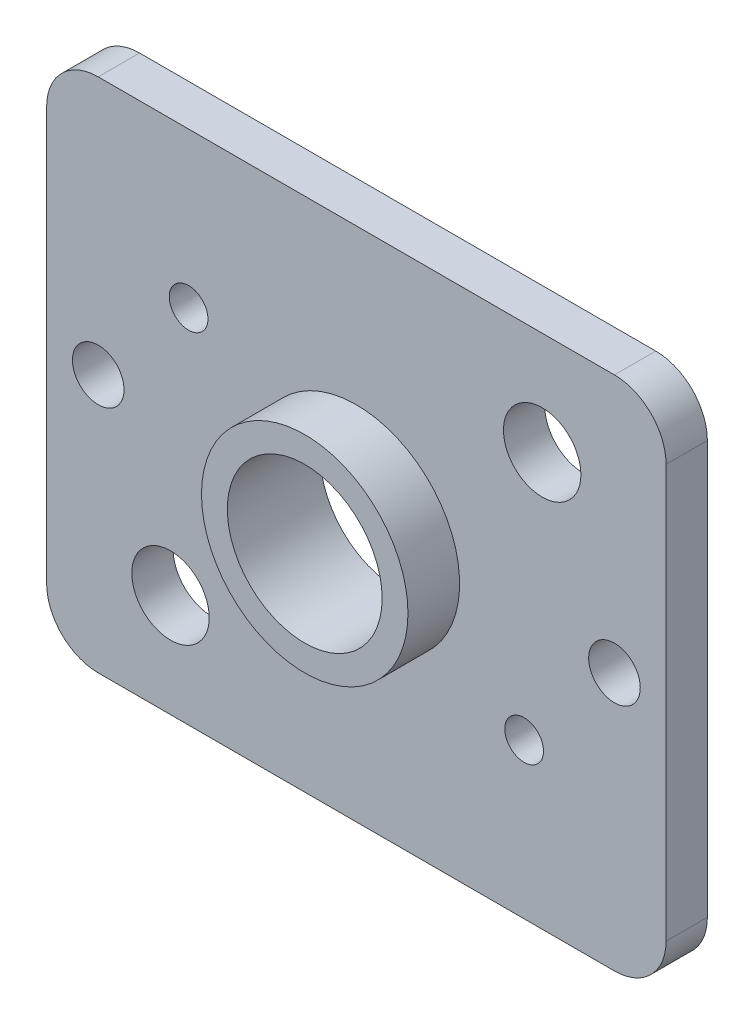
ISO-10303-21;
HEADER;
FILE_DESCRIPTION(('STEP AP214'),'2;1');
FILE_NAME('part.step','',(''),(''),'','','');
FILE_SCHEMA(('AUTOMOTIVE_DESIGN { 1 0 10303 214 1 1 1 1 }'));
ENDSEC;
DATA;
#1=APPLICATION_CONTEXT('core data for automotive mechanical design processes');
#2=APPLICATION_PROTOCOL_DEFINITION('international standard','automotive_design',2000,#1);
#3=PRODUCT_CONTEXT('',#1,'mechanical');
#4=PRODUCT('Part','Part','',(#3));
#5=PRODUCT_RELATED_PRODUCT_CATEGORY('part','',(#4));
#6=PRODUCT_DEFINITION_FORMATION('','',#4);
#7=PRODUCT_DEFINITION_CONTEXT('part definition',#1,'design');
#8=PRODUCT_DEFINITION('design','',#6,#7);
#9=PRODUCT_DEFINITION_SHAPE('','',#8);
#10=(LENGTH_UNIT() NAMED_UNIT(*) SI_UNIT(.MILLI.,.METRE.));
#11=(NAMED_UNIT(*) PLANE_ANGLE_UNIT() SI_UNIT($,.RADIAN.));
#12=(NAMED_UNIT(*) SI_UNIT($,.STERADIAN.) SOLID_ANGLE_UNIT());
#13=UNCERTAINTY_MEASURE_WITH_UNIT(LENGTH_MEASURE(1.E-05),#10,'distance_accuracy_value','');
#14=(GEOMETRIC_REPRESENTATION_CONTEXT(3) GLOBAL_UNCERTAINTY_ASSIGNED_CONTEXT((#13)) GLOBAL_UNIT_ASSIGNED_CONTEXT((#10,
#11,#12)) REPRESENTATION_CONTEXT('',''));
#15=CARTESIAN_POINT('',(0.,0.,0.));
#16=DIRECTION('',(0.,0.,1.));
#17=DIRECTION('',(1.,0.,0.));
#18=AXIS2_PLACEMENT_3D('',#15,#16,#17);
#19=CARTESIAN_POINT('',(0.,0.,0.8));
#20=DIRECTION('',(0.,0.,-1.));
#21=DIRECTION('',(-1.,0.,0.));
#22=AXIS2_PLACEMENT_3D('',#19,#20,#21);
#23=PLANE('',#22);
#24=DIRECTION('',(1.,0.,0.));
#25=VECTOR('',#24,1.);
#26=CARTESIAN_POINT('',(-6.,-5.,0.8));
#27=LINE('',#26,#25);
#28=CARTESIAN_POINT('',(-5.,-5.,0.8));
#29=VERTEX_POINT('',#28);
#30=CARTESIAN_POINT('',(5.,-5.,0.8));
#31=VERTEX_POINT('',#30);
#32=EDGE_CURVE('E137',#29,#31,#27,.T.);
#33=ORIENTED_EDGE('',*,*,#32,.T.);
#34=CARTESIAN_POINT('',(5.,-4.,0.8));
#35=DIRECTION('',(0.,0.,-1.));
#36=DIRECTION('',(-1.,0.,0.));
#37=AXIS2_PLACEMENT_3D('',#34,#35,#36);
#38=CIRCLE('',#37,1.);
#39=CARTESIAN_POINT('',(6.,-4.,0.8));
#40=VERTEX_POINT('',#39);
#41=EDGE_CURVE('E156',#31,#40,#38,.F.);
#42=ORIENTED_EDGE('',*,*,#41,.T.);
#43=DIRECTION('',(0.,1.,0.));
#44=VECTOR('',#43,1.);
#45=CARTESIAN_POINT('',(6.,-5.,0.8));
#46=LINE('',#45,#44);
#47=CARTESIAN_POINT('',(6.,4.,0.8));
#48=VERTEX_POINT('',#47);
#49=EDGE_CURVE('E121',#40,#48,#46,.T.);
#50=ORIENTED_EDGE('',*,*,#49,.T.);
#51=CARTESIAN_POINT('',(5.,4.,0.8));
#52=DIRECTION('',(0.,0.,-1.));
#53=DIRECTION('',(-1.,0.,0.));
#54=AXIS2_PLACEMENT_3D('',#51,#52,#53);
#55=CIRCLE('',#54,1.);
#56=CARTESIAN_POINT('',(5.,5.,0.8));
#57=VERTEX_POINT('',#56);
#58=EDGE_CURVE('E151',#48,#57,#55,.F.);
#59=ORIENTED_EDGE('',*,*,#58,.T.);
#60=DIRECTION('',(-1.,0.,0.));
#61=VECTOR('',#60,1.);
#62=CARTESIAN_POINT('',(-6.,5.,0.8));
#63=LINE('',#62,#61);
#64=CARTESIAN_POINT('',(-5.,5.,0.8));
#65=VERTEX_POINT('',#64);
#66=EDGE_CURVE('E168',#57,#65,#63,.T.);
#67=ORIENTED_EDGE('',*,*,#66,.T.);
#68=CARTESIAN_POINT('',(-5.,4.,0.8));
#69=DIRECTION('',(0.,0.,-1.));
#70=DIRECTION('',(-1.,0.,0.));
#71=AXIS2_PLACEMENT_3D('',#68,#69,#70);
#72=CIRCLE('',#71,1.);
#73=CARTESIAN_POINT('',(-6.,4.,0.8));
#74=VERTEX_POINT('',#73);
#75=EDGE_CURVE('E56',#65,#74,#72,.F.);
#76=ORIENTED_EDGE('',*,*,#75,.T.);
#77=DIRECTION('',(0.,-1.,0.));
#78=VECTOR('',#77,1.);
#79=CARTESIAN_POINT('',(-6.,-5.,0.8));
#80=LINE('',#79,#78);
#81=CARTESIAN_POINT('',(-6.,-4.,0.8));
#82=VERTEX_POINT('',#81);
#83=EDGE_CURVE('E174',#74,#82,#80,.T.);
#84=ORIENTED_EDGE('',*,*,#83,.T.);
#85=CARTESIAN_POINT('',(-5.,-4.,0.8));
#86=DIRECTION('',(0.,0.,-1.));
#87=DIRECTION('',(-1.,0.,0.));
#88=AXIS2_PLACEMENT_3D('',#85,#86,#87);
#89=CIRCLE('',#88,1.);
#90=EDGE_CURVE('E154',#82,#29,#89,.F.);
#91=ORIENTED_EDGE('',*,*,#90,.T.);
#92=EDGE_LOOP('',(#33,#42,#50,#59,#67,#76,#84,#91));
#93=FACE_BOUND('',#92,.T.);
#94=CARTESIAN_POINT('',(-3.6,-3.,0.8));
#95=DIRECTION('',(0.,0.,1.));
#96=DIRECTION('',(1.,0.,0.));
#97=AXIS2_PLACEMENT_3D('',#94,#95,#96);
#98=CIRCLE('',#97,0.75);
#99=CARTESIAN_POINT('',(-2.84999999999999,-3.,0.8));
#100=VERTEX_POINT('',#99);
#101=EDGE_CURVE('E134',#100,#100,#98,.T.);
#102=ORIENTED_EDGE('',*,*,#101,.F.);
#103=EDGE_LOOP('',(#102));
#104=FACE_BOUND('',#103,.T.);
#105=CARTESIAN_POINT('',(3.6,3.,0.8));
#106=DIRECTION('',(0.,0.,1.));
#107=DIRECTION('',(1.,0.,0.));
#108=AXIS2_PLACEMENT_3D('',#105,#106,#107);
#109=CIRCLE('',#108,0.750000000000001);
#110=CARTESIAN_POINT('',(4.35,3.,0.8));
#111=VERTEX_POINT('',#110);
#112=EDGE_CURVE('E192',#111,#111,#109,.T.);
#113=ORIENTED_EDGE('',*,*,#112,.F.);
#114=EDGE_LOOP('',(#113));
#115=FACE_BOUND('',#114,.T.);
#116=CARTESIAN_POINT('',(3.25,-2.,0.8));
#117=DIRECTION('',(0.,0.,1.));
#118=DIRECTION('',(1.,0.,0.));
#119=AXIS2_PLACEMENT_3D('',#116,#117,#118);
#120=CIRCLE('',#119,0.375);
#121=CARTESIAN_POINT('',(3.625,-2.,0.8));
#122=VERTEX_POINT('',#121);
#123=EDGE_CURVE('E193',#122,#122,#120,.T.);
#124=ORIENTED_EDGE('',*,*,#123,.F.);
#125=EDGE_LOOP('',(#124));
#126=FACE_BOUND('',#125,.T.);
#127=CARTESIAN_POINT('',(-3.24999999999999,2.00000000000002,0.8));
#128=DIRECTION('',(0.,0.,1.));
#129=DIRECTION('',(1.,0.,0.));
#130=AXIS2_PLACEMENT_3D('',#127,#128,#129);
#131=CIRCLE('',#130,0.375);
#132=CARTESIAN_POINT('',(-2.87499999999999,2.00000000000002,0.8));
#133=VERTEX_POINT('',#132);
#134=EDGE_CURVE('E204',#133,#133,#131,.T.);
#135=ORIENTED_EDGE('',*,*,#134,.F.);
#136=EDGE_LOOP('',(#135));
#137=FACE_BOUND('',#136,.T.);
#138=CARTESIAN_POINT('',(-5.,0.,0.8));
#139=DIRECTION('',(0.,0.,1.));
#140=DIRECTION('',(1.,0.,0.));
#141=AXIS2_PLACEMENT_3D('',#138,#139,#140);
#142=CIRCLE('',#141,0.500000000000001);
#143=CARTESIAN_POINT('',(-4.5,0.,0.8));
#144=VERTEX_POINT('',#143);
#145=EDGE_CURVE('E213',#144,#144,#142,.T.);
#146=ORIENTED_EDGE('',*,*,#145,.F.);
#147=EDGE_LOOP('',(#146));
#148=FACE_BOUND('',#147,.T.);
#149=CARTESIAN_POINT('',(5.,0.,0.8));
#150=DIRECTION('',(0.,0.,1.));
#151=DIRECTION('',(1.,0.,0.));
#152=AXIS2_PLACEMENT_3D('',#149,#150,#151);
#153=CIRCLE('',#152,0.500000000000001);
#154=CARTESIAN_POINT('',(5.5,0.,0.8));
#155=VERTEX_POINT('',#154);
#156=EDGE_CURVE('E219',#155,#155,#153,.T.);
#157=ORIENTED_EDGE('',*,*,#156,.F.);
#158=EDGE_LOOP('',(#157));
#159=FACE_BOUND('',#158,.T.);
#160=CARTESIAN_POINT('',(0.,0.,0.8));
#161=DIRECTION('',(0.,0.,-1.));
#162=DIRECTION('',(-1.,0.,0.));
#163=AXIS2_PLACEMENT_3D('',#160,#161,#162);
#164=CIRCLE('',#163,2.);
#165=CARTESIAN_POINT('',(-2.,0.,0.8));
#166=VERTEX_POINT('',#165);
#167=EDGE_CURVE('E11',#166,#166,#164,.F.);
#168=ORIENTED_EDGE('',*,*,#167,.F.);
#169=EDGE_LOOP('',(#168));
#170=FACE_BOUND('',#169,.T.);
#171=ADVANCED_FACE('F34',(#93,#104,#115,#126,#137,#148,#159,#170),#23,.F.);
#172=CARTESIAN_POINT('',(6.,-5.,0.8));
#173=DIRECTION('',(-1.,0.,0.));
#174=DIRECTION('',(0.,0.,1.));
#175=AXIS2_PLACEMENT_3D('',#172,#173,#174);
#176=PLANE('',#175);
#177=ORIENTED_EDGE('',*,*,#49,.F.);
#178=DIRECTION('',(0.,0.,-1.));
#179=VECTOR('',#178,1.);
#180=CARTESIAN_POINT('',(6.,-4.,0.8));
#181=LINE('',#180,#179);
#182=CARTESIAN_POINT('',(6.,-4.,0.));
#183=VERTEX_POINT('',#182);
#184=EDGE_CURVE('E105',#40,#183,#181,.T.);
#185=ORIENTED_EDGE('',*,*,#184,.T.);
#186=DIRECTION('',(0.,1.,0.));
#187=VECTOR('',#186,1.);
#188=CARTESIAN_POINT('',(6.,-5.,0.));
#189=LINE('',#188,#187);
#190=CARTESIAN_POINT('',(6.,4.,0.));
#191=VERTEX_POINT('',#190);
#192=EDGE_CURVE('E118',#183,#191,#189,.T.);
#193=ORIENTED_EDGE('',*,*,#192,.T.);
#194=DIRECTION('',(0.,0.,-1.));
#195=VECTOR('',#194,1.);
#196=CARTESIAN_POINT('',(6.,4.,0.8));
#197=LINE('',#196,#195);
#198=EDGE_CURVE('E123',#191,#48,#197,.F.);
#199=ORIENTED_EDGE('',*,*,#198,.T.);
#200=EDGE_LOOP('',(#177,#185,#193,#199));
#201=FACE_BOUND('',#200,.T.);
#202=ADVANCED_FACE('F117',(#201),#176,.F.);
#203=CARTESIAN_POINT('',(-6.,5.,0.8));
#204=DIRECTION('',(0.,-1.,0.));
#205=DIRECTION('',(0.,0.,-1.));
#206=AXIS2_PLACEMENT_3D('',#203,#204,#205);
#207=PLANE('',#206);
#208=DIRECTION('',(-1.,0.,0.));
#209=VECTOR('',#208,1.);
#210=CARTESIAN_POINT('',(-6.,5.,0.));
#211=LINE('',#210,#209);
#212=CARTESIAN_POINT('',(5.,5.,0.));
#213=VERTEX_POINT('',#212);
#214=CARTESIAN_POINT('',(-5.,5.,0.));
#215=VERTEX_POINT('',#214);
#216=EDGE_CURVE('E127',#213,#215,#211,.T.);
#217=ORIENTED_EDGE('',*,*,#216,.T.);
#218=DIRECTION('',(0.,0.,-1.));
#219=VECTOR('',#218,1.);
#220=CARTESIAN_POINT('',(-5.,5.,0.8));
#221=LINE('',#220,#219);
#222=EDGE_CURVE('E42',#215,#65,#221,.F.);
#223=ORIENTED_EDGE('',*,*,#222,.T.);
#224=ORIENTED_EDGE('',*,*,#66,.F.);
#225=DIRECTION('',(0.,0.,-1.));
#226=VECTOR('',#225,1.);
#227=CARTESIAN_POINT('',(5.,5.,0.8));
#228=LINE('',#227,#226);
#229=EDGE_CURVE('E162',#57,#213,#228,.T.);
#230=ORIENTED_EDGE('',*,*,#229,.T.);
#231=EDGE_LOOP('',(#217,#223,#224,#230));
#232=FACE_BOUND('',#231,.T.);
#233=ADVANCED_FACE('F167',(#232),#207,.F.);
#234=CARTESIAN_POINT('',(-6.,-5.,0.8));
#235=DIRECTION('',(1.,0.,0.));
#236=DIRECTION('',(0.,0.,-1.));
#237=AXIS2_PLACEMENT_3D('',#234,#235,#236);
#238=PLANE('',#237);
#239=DIRECTION('',(0.,-1.,0.));
#240=VECTOR('',#239,1.);
#241=CARTESIAN_POINT('',(-6.,-5.,0.));
#242=LINE('',#241,#240);
#243=CARTESIAN_POINT('',(-6.,4.,0.));
#244=VERTEX_POINT('',#243);
#245=CARTESIAN_POINT('',(-6.,-4.,0.));
#246=VERTEX_POINT('',#245);
#247=EDGE_CURVE('E131',#244,#246,#242,.T.);
#248=ORIENTED_EDGE('',*,*,#247,.T.);
#249=DIRECTION('',(0.,0.,-1.));
#250=VECTOR('',#249,1.);
#251=CARTESIAN_POINT('',(-6.,-4.,0.8));
#252=LINE('',#251,#250);
#253=EDGE_CURVE('E49',#246,#82,#252,.F.);
#254=ORIENTED_EDGE('',*,*,#253,.T.);
#255=ORIENTED_EDGE('',*,*,#83,.F.);
#256=DIRECTION('',(0.,0.,-1.));
#257=VECTOR('',#256,1.);
#258=CARTESIAN_POINT('',(-6.,4.,0.8));
#259=LINE('',#258,#257);
#260=EDGE_CURVE('E158',#74,#244,#259,.T.);
#261=ORIENTED_EDGE('',*,*,#260,.T.);
#262=EDGE_LOOP('',(#248,#254,#255,#261));
#263=FACE_BOUND('',#262,.T.);
#264=ADVANCED_FACE('F179',(#263),#238,.F.);
#265=CARTESIAN_POINT('',(-6.,-5.,0.8));
#266=DIRECTION('',(0.,1.,0.));
#267=DIRECTION('',(0.,0.,1.));
#268=AXIS2_PLACEMENT_3D('',#265,#266,#267);
#269=PLANE('',#268);
#270=DIRECTION('',(1.,0.,0.));
#271=VECTOR('',#270,1.);
#272=CARTESIAN_POINT('',(-6.,-5.,0.));
#273=LINE('',#272,#271);
#274=CARTESIAN_POINT('',(-5.,-5.,0.));
#275=VERTEX_POINT('',#274);
#276=CARTESIAN_POINT('',(5.,-5.,0.));
#277=VERTEX_POINT('',#276);
#278=EDGE_CURVE('E141',#275,#277,#273,.T.);
#279=ORIENTED_EDGE('',*,*,#278,.T.);
#280=DIRECTION('',(0.,0.,-1.));
#281=VECTOR('',#280,1.);
#282=CARTESIAN_POINT('',(5.,-5.,0.8));
#283=LINE('',#282,#281);
#284=EDGE_CURVE('E106',#277,#31,#283,.F.);
#285=ORIENTED_EDGE('',*,*,#284,.T.);
#286=ORIENTED_EDGE('',*,*,#32,.F.);
#287=DIRECTION('',(0.,0.,-1.));
#288=VECTOR('',#287,1.);
#289=CARTESIAN_POINT('',(-5.,-5.,0.8));
#290=LINE('',#289,#288);
#291=EDGE_CURVE('E111',#29,#275,#290,.T.);
#292=ORIENTED_EDGE('',*,*,#291,.T.);
#293=EDGE_LOOP('',(#279,#285,#286,#292));
#294=FACE_BOUND('',#293,.T.);
#295=ADVANCED_FACE('F186',(#294),#269,.F.);
#296=CARTESIAN_POINT('',(0.,0.,0.));
#297=DIRECTION('',(0.,0.,-1.));
#298=DIRECTION('',(-1.,0.,0.));
#299=AXIS2_PLACEMENT_3D('',#296,#297,#298);
#300=PLANE('',#299);
#301=CARTESIAN_POINT('',(5.,0.,0.));
#302=DIRECTION('',(0.,0.,1.));
#303=DIRECTION('',(1.,0.,0.));
#304=AXIS2_PLACEMENT_3D('',#301,#302,#303);
#305=CIRCLE('',#304,0.500000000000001);
#306=CARTESIAN_POINT('',(5.5,0.,0.));
#307=VERTEX_POINT('',#306);
#308=EDGE_CURVE('E216',#307,#307,#305,.T.);
#309=ORIENTED_EDGE('',*,*,#308,.T.);
#310=EDGE_LOOP('',(#309));
#311=FACE_BOUND('',#310,.T.);
#312=CARTESIAN_POINT('',(-5.,0.,0.));
#313=DIRECTION('',(0.,0.,1.));
#314=DIRECTION('',(1.,0.,0.));
#315=AXIS2_PLACEMENT_3D('',#312,#313,#314);
#316=CIRCLE('',#315,0.500000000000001);
#317=CARTESIAN_POINT('',(-4.5,0.,0.));
#318=VERTEX_POINT('',#317);
#319=EDGE_CURVE('E205',#318,#318,#316,.T.);
#320=ORIENTED_EDGE('',*,*,#319,.T.);
#321=EDGE_LOOP('',(#320));
#322=FACE_BOUND('',#321,.T.);
#323=CARTESIAN_POINT('',(-3.24999999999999,2.00000000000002,0.));
#324=DIRECTION('',(0.,0.,-1.));
#325=DIRECTION('',(-1.,0.,0.));
#326=AXIS2_PLACEMENT_3D('',#323,#324,#325);
#327=CIRCLE('',#326,0.375);
#328=CARTESIAN_POINT('',(-3.62499999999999,2.00000000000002,0.));
#329=VERTEX_POINT('',#328);
#330=EDGE_CURVE('E201',#329,#329,#327,.F.);
#331=ORIENTED_EDGE('',*,*,#330,.T.);
#332=EDGE_LOOP('',(#331));
#333=FACE_BOUND('',#332,.T.);
#334=CARTESIAN_POINT('',(3.25,-2.,0.));
#335=DIRECTION('',(0.,0.,-1.));
#336=DIRECTION('',(-1.,0.,0.));
#337=AXIS2_PLACEMENT_3D('',#334,#335,#336);
#338=CIRCLE('',#337,0.375);
#339=CARTESIAN_POINT('',(2.875,-2.,0.));
#340=VERTEX_POINT('',#339);
#341=EDGE_CURVE('E208',#340,#340,#338,.F.);
#342=ORIENTED_EDGE('',*,*,#341,.T.);
#343=EDGE_LOOP('',(#342));
#344=FACE_BOUND('',#343,.T.);
#345=CARTESIAN_POINT('',(3.6,3.,0.));
#346=DIRECTION('',(0.,0.,-1.));
#347=DIRECTION('',(-1.,0.,0.));
#348=AXIS2_PLACEMENT_3D('',#345,#346,#347);
#349=CIRCLE('',#348,0.750000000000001);
#350=CARTESIAN_POINT('',(4.35,3.,0.));
#351=VERTEX_POINT('',#350);
#352=EDGE_CURVE('E189',#351,#351,#349,.F.);
#353=ORIENTED_EDGE('',*,*,#352,.T.);
#354=EDGE_LOOP('',(#353));
#355=FACE_BOUND('',#354,.T.);
#356=CARTESIAN_POINT('',(-3.6,-3.,0.));
#357=DIRECTION('',(0.,0.,-1.));
#358=DIRECTION('',(-1.,0.,0.));
#359=AXIS2_PLACEMENT_3D('',#356,#357,#358);
#360=CIRCLE('',#359,0.75);
#361=CARTESIAN_POINT('',(-2.84999999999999,-3.,0.));
#362=VERTEX_POINT('',#361);
#363=EDGE_CURVE('E196',#362,#362,#360,.F.);
#364=ORIENTED_EDGE('',*,*,#363,.T.);
#365=EDGE_LOOP('',(#364));
#366=FACE_BOUND('',#365,.T.);
#367=CARTESIAN_POINT('',(0.,0.,0.));
#368=DIRECTION('',(0.,0.,-1.));
#369=DIRECTION('',(-1.,0.,0.));
#370=AXIS2_PLACEMENT_3D('',#367,#368,#369);
#371=CIRCLE('',#370,1.5);
#372=CARTESIAN_POINT('',(1.5,0.,0.));
#373=VERTEX_POINT('',#372);
#374=EDGE_CURVE('E128',#373,#373,#371,.F.);
#375=ORIENTED_EDGE('',*,*,#374,.T.);
#376=EDGE_LOOP('',(#375));
#377=FACE_BOUND('',#376,.T.);
#378=ORIENTED_EDGE('',*,*,#192,.F.);
#379=CARTESIAN_POINT('',(5.,-4.,0.));
#380=DIRECTION('',(0.,0.,-1.));
#381=DIRECTION('',(-1.,0.,0.));
#382=AXIS2_PLACEMENT_3D('',#379,#380,#381);
#383=CIRCLE('',#382,1.);
#384=EDGE_CURVE('E101',#183,#277,#383,.T.);
#385=ORIENTED_EDGE('',*,*,#384,.T.);
#386=ORIENTED_EDGE('',*,*,#278,.F.);
#387=CARTESIAN_POINT('',(-5.,-4.,0.));
#388=DIRECTION('',(0.,0.,-1.));
#389=DIRECTION('',(-1.,0.,0.));
#390=AXIS2_PLACEMENT_3D('',#387,#388,#389);
#391=CIRCLE('',#390,1.);
#392=EDGE_CURVE('E112',#275,#246,#391,.T.);
#393=ORIENTED_EDGE('',*,*,#392,.T.);
#394=ORIENTED_EDGE('',*,*,#247,.F.);
#395=CARTESIAN_POINT('',(-5.,4.,0.));
#396=DIRECTION('',(0.,0.,-1.));
#397=DIRECTION('',(-1.,0.,0.));
#398=AXIS2_PLACEMENT_3D('',#395,#396,#397);
#399=CIRCLE('',#398,1.);
#400=EDGE_CURVE('E145',#244,#215,#399,.T.);
#401=ORIENTED_EDGE('',*,*,#400,.T.);
#402=ORIENTED_EDGE('',*,*,#216,.F.);
#403=CARTESIAN_POINT('',(5.,4.,0.));
#404=DIRECTION('',(0.,0.,-1.));
#405=DIRECTION('',(-1.,0.,0.));
#406=AXIS2_PLACEMENT_3D('',#403,#404,#405);
#407=CIRCLE('',#406,1.);
#408=EDGE_CURVE('E122',#213,#191,#407,.T.);
#409=ORIENTED_EDGE('',*,*,#408,.T.);
#410=EDGE_LOOP('',(#378,#385,#386,#393,#394,#401,#402,#409));
#411=FACE_BOUND('',#410,.T.);
#412=ADVANCED_FACE('F125',(#311,#322,#333,#344,#355,#366,#377,#411),#300,.T.);
#413=CARTESIAN_POINT('',(0.,0.,-0.00100000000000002));
#414=DIRECTION('',(0.,0.,1.));
#415=DIRECTION('',(1.,0.,0.));
#416=AXIS2_PLACEMENT_3D('',#413,#414,#415);
#417=CYLINDRICAL_SURFACE('',#416,1.5);
#418=CARTESIAN_POINT('',(0.,0.,1.8));
#419=DIRECTION('',(0.,0.,1.));
#420=DIRECTION('',(1.,0.,0.));
#421=AXIS2_PLACEMENT_3D('',#418,#419,#420);
#422=CIRCLE('',#421,1.5);
#423=CARTESIAN_POINT('',(1.5,0.,1.8));
#424=VERTEX_POINT('',#423);
#425=EDGE_CURVE('E227',#424,#424,#422,.T.);
#426=CARTESIAN_POINT('',(1.5,0.,0.));
#427=CARTESIAN_POINT('',(1.5,0.,0.01875));
#428=CARTESIAN_POINT('',(1.5,0.,0.0375));
#429=CARTESIAN_POINT('',(1.5,0.,0.075));
#430=CARTESIAN_POINT('',(1.5,0.,0.09375));
#431=CARTESIAN_POINT('',(1.5,0.,0.13125));
#432=CARTESIAN_POINT('',(1.5,0.,0.15));
#433=CARTESIAN_POINT('',(1.5,0.,0.1875));
#434=CARTESIAN_POINT('',(1.5,0.,0.20625));
#435=CARTESIAN_POINT('',(1.5,0.,0.24375));
#436=CARTESIAN_POINT('',(1.5,0.,0.2625));
#437=CARTESIAN_POINT('',(1.5,0.,0.3));
#438=CARTESIAN_POINT('',(1.5,0.,0.31875));
#439=CARTESIAN_POINT('',(1.5,0.,0.35625));
#440=CARTESIAN_POINT('',(1.5,0.,0.375));
#441=CARTESIAN_POINT('',(1.5,0.,0.4125));
#442=CARTESIAN_POINT('',(1.5,0.,0.43125));
#443=CARTESIAN_POINT('',(1.5,0.,0.46875));
#444=CARTESIAN_POINT('',(1.5,0.,0.4875));
#445=CARTESIAN_POINT('',(1.5,0.,0.525));
#446=CARTESIAN_POINT('',(1.5,0.,0.54375));
#447=CARTESIAN_POINT('',(1.5,0.,0.58125));
#448=CARTESIAN_POINT('',(1.5,0.,0.6));
#449=CARTESIAN_POINT('',(1.5,0.,0.6375));
#450=CARTESIAN_POINT('',(1.5,0.,0.65625));
#451=CARTESIAN_POINT('',(1.5,0.,0.69375));
#452=CARTESIAN_POINT('',(1.5,0.,0.7125));
#453=CARTESIAN_POINT('',(1.5,0.,0.75));
#454=CARTESIAN_POINT('',(1.5,0.,0.76875));
#455=CARTESIAN_POINT('',(1.5,0.,0.80625));
#456=CARTESIAN_POINT('',(1.5,0.,0.825));
#457=CARTESIAN_POINT('',(1.5,0.,0.8625));
#458=CARTESIAN_POINT('',(1.5,0.,0.88125));
#459=CARTESIAN_POINT('',(1.5,0.,0.91875));
#460=CARTESIAN_POINT('',(1.5,0.,0.9375));
#461=CARTESIAN_POINT('',(1.5,0.,0.975));
#462=CARTESIAN_POINT('',(1.5,0.,0.99375));
#463=CARTESIAN_POINT('',(1.5,0.,1.03125));
#464=CARTESIAN_POINT('',(1.5,0.,1.05));
#465=CARTESIAN_POINT('',(1.5,0.,1.0875));
#466=CARTESIAN_POINT('',(1.5,0.,1.10625));
#467=CARTESIAN_POINT('',(1.5,0.,1.14375));
#468=CARTESIAN_POINT('',(1.5,0.,1.1625));
#469=CARTESIAN_POINT('',(1.5,0.,1.2));
#470=CARTESIAN_POINT('',(1.5,0.,1.21875));
#471=CARTESIAN_POINT('',(1.5,0.,1.25625));
#472=CARTESIAN_POINT('',(1.5,0.,1.275));
#473=CARTESIAN_POINT('',(1.5,0.,1.3125));
#474=CARTESIAN_POINT('',(1.5,0.,1.33125));
#475=CARTESIAN_POINT('',(1.5,0.,1.36875));
#476=CARTESIAN_POINT('',(1.5,0.,1.3875));
#477=CARTESIAN_POINT('',(1.5,0.,1.425));
#478=CARTESIAN_POINT('',(1.5,0.,1.44375));
#479=CARTESIAN_POINT('',(1.5,0.,1.48125));
#480=CARTESIAN_POINT('',(1.5,0.,1.5));
#481=CARTESIAN_POINT('',(1.5,0.,1.5375));
#482=CARTESIAN_POINT('',(1.5,0.,1.55625));
#483=CARTESIAN_POINT('',(1.5,0.,1.59375));
#484=CARTESIAN_POINT('',(1.5,0.,1.6125));
#485=CARTESIAN_POINT('',(1.5,0.,1.65));
#486=CARTESIAN_POINT('',(1.5,0.,1.66875));
#487=CARTESIAN_POINT('',(1.5,0.,1.70625));
#488=CARTESIAN_POINT('',(1.5,0.,1.725));
#489=CARTESIAN_POINT('',(1.5,0.,1.7625));
#490=CARTESIAN_POINT('',(1.5,0.,1.78125));
#491=CARTESIAN_POINT('',(1.5,0.,1.8));
#492=B_SPLINE_CURVE_WITH_KNOTS('',3,(#426,#427,#428,#429,#430,#431,#432,#433,#434,#435,#436,
#437,#438,#439,#440,#441,#442,#443,#444,#445,#446,#447,#448,#449,#450,#451,#452,#453,#454,#455,
#456,#457,#458,#459,#460,#461,#462,#463,#464,#465,#466,#467,#468,#469,#470,#471,#472,#473,#474,
#475,#476,#477,#478,#479,#480,#481,#482,#483,#484,#485,#486,#487,#488,#489,#490,#491),
.UNSPECIFIED.,.F.,.F.,(4,2,2,2,2,2,2,2,2,2,2,2,2,2,2,2,2,2,2,2,2,2,2,2,2,2,2,2,2,2,2,2,4),(0.,
0.05625,0.1125,0.16875,0.225,0.28125,0.3375,0.39375,0.45,0.50625,0.5625,0.61875,0.675,0.73125,
0.7875,0.84375,0.9,0.95625,1.0125,1.06875,1.125,1.18125,1.2375,1.29375,1.35,1.40625,1.4625,
1.51875,1.575,1.63125,1.6875,1.74375,1.8),.UNSPECIFIED.);
#493=EDGE_CURVE('BSEAM231',#373,#424,#492,.T.);
#494=ORIENTED_EDGE('',*,*,#374,.F.);
#495=ORIENTED_EDGE('',*,*,#425,.T.);
#496=ORIENTED_EDGE('',*,*,#493,.T.);
#497=ORIENTED_EDGE('',*,*,#493,.F.);
#498=EDGE_LOOP('',(#494,#496,#495,#497));
#499=FACE_BOUND('',#498,.T.);
#500=ADVANCED_FACE('F231',(#499),#417,.F.);
#501=CARTESIAN_POINT('',(-3.6,-3.,-0.00100000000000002));
#502=DIRECTION('',(0.,0.,1.));
#503=DIRECTION('',(1.,0.,0.));
#504=AXIS2_PLACEMENT_3D('',#501,#502,#503);
#505=CYLINDRICAL_SURFACE('',#504,0.75);
#506=CARTESIAN_POINT('',(-2.84999999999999,-3.,0.));
#507=CARTESIAN_POINT('',(-2.84999999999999,-3.,0.00833333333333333));
#508=CARTESIAN_POINT('',(-2.84999999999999,-3.,0.0166666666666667));
#509=CARTESIAN_POINT('',(-2.84999999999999,-3.,0.0333333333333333));
#510=CARTESIAN_POINT('',(-2.84999999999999,-3.,0.0416666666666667));
#511=CARTESIAN_POINT('',(-2.84999999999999,-3.,0.0583333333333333));
#512=CARTESIAN_POINT('',(-2.84999999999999,-3.,0.0666666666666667));
#513=CARTESIAN_POINT('',(-2.84999999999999,-3.,0.0833333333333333));
#514=CARTESIAN_POINT('',(-2.84999999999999,-3.,0.0916666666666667));
#515=CARTESIAN_POINT('',(-2.84999999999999,-3.,0.108333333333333));
#516=CARTESIAN_POINT('',(-2.84999999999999,-3.,0.116666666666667));
#517=CARTESIAN_POINT('',(-2.84999999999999,-3.,0.133333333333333));
#518=CARTESIAN_POINT('',(-2.84999999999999,-3.,0.141666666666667));
#519=CARTESIAN_POINT('',(-2.84999999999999,-3.,0.158333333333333));
#520=CARTESIAN_POINT('',(-2.84999999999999,-3.,0.166666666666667));
#521=CARTESIAN_POINT('',(-2.84999999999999,-3.,0.183333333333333));
#522=CARTESIAN_POINT('',(-2.84999999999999,-3.,0.191666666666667));
#523=CARTESIAN_POINT('',(-2.84999999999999,-3.,0.208333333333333));
#524=CARTESIAN_POINT('',(-2.84999999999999,-3.,0.216666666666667));
#525=CARTESIAN_POINT('',(-2.84999999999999,-3.,0.233333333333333));
#526=CARTESIAN_POINT('',(-2.84999999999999,-3.,0.241666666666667));
#527=CARTESIAN_POINT('',(-2.84999999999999,-3.,0.258333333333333));
#528=CARTESIAN_POINT('',(-2.84999999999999,-3.,0.266666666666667));
#529=CARTESIAN_POINT('',(-2.84999999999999,-3.,0.283333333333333));
#530=CARTESIAN_POINT('',(-2.84999999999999,-3.,0.291666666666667));
#531=CARTESIAN_POINT('',(-2.84999999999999,-3.,0.308333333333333));
#532=CARTESIAN_POINT('',(-2.84999999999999,-3.,0.316666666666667));
#533=CARTESIAN_POINT('',(-2.84999999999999,-3.,0.333333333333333));
#534=CARTESIAN_POINT('',(-2.84999999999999,-3.,0.341666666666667));
#535=CARTESIAN_POINT('',(-2.84999999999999,-3.,0.358333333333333));
#536=CARTESIAN_POINT('',(-2.84999999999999,-3.,0.366666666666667));
#537=CARTESIAN_POINT('',(-2.84999999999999,-3.,0.383333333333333));
#538=CARTESIAN_POINT('',(-2.84999999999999,-3.,0.391666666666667));
#539=CARTESIAN_POINT('',(-2.84999999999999,-3.,0.408333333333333));
#540=CARTESIAN_POINT('',(-2.84999999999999,-3.,0.416666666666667));
#541=CARTESIAN_POINT('',(-2.84999999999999,-3.,0.433333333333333));
#542=CARTESIAN_POINT('',(-2.84999999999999,-3.,0.441666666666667));
#543=CARTESIAN_POINT('',(-2.84999999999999,-3.,0.458333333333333));
#544=CARTESIAN_POINT('',(-2.84999999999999,-3.,0.466666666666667));
#545=CARTESIAN_POINT('',(-2.84999999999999,-3.,0.483333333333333));
#546=CARTESIAN_POINT('',(-2.84999999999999,-3.,0.491666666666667));
#547=CARTESIAN_POINT('',(-2.84999999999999,-3.,0.508333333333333));
#548=CARTESIAN_POINT('',(-2.84999999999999,-3.,0.516666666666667));
#549=CARTESIAN_POINT('',(-2.84999999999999,-3.,0.533333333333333));
#550=CARTESIAN_POINT('',(-2.84999999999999,-3.,0.541666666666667));
#551=CARTESIAN_POINT('',(-2.84999999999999,-3.,0.558333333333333));
#552=CARTESIAN_POINT('',(-2.84999999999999,-3.,0.566666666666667));
#553=CARTESIAN_POINT('',(-2.84999999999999,-3.,0.583333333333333));
#554=CARTESIAN_POINT('',(-2.84999999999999,-3.,0.591666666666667));
#555=CARTESIAN_POINT('',(-2.84999999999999,-3.,0.608333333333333));
#556=CARTESIAN_POINT('',(-2.84999999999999,-3.,0.616666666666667));
#557=CARTESIAN_POINT('',(-2.84999999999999,-3.,0.633333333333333));
#558=CARTESIAN_POINT('',(-2.84999999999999,-3.,0.641666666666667));
#559=CARTESIAN_POINT('',(-2.84999999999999,-3.,0.658333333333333));
#560=CARTESIAN_POINT('',(-2.84999999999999,-3.,0.666666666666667));
#561=CARTESIAN_POINT('',(-2.84999999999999,-3.,0.683333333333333));
#562=CARTESIAN_POINT('',(-2.84999999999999,-3.,0.691666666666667));
#563=CARTESIAN_POINT('',(-2.84999999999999,-3.,0.708333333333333));
#564=CARTESIAN_POINT('',(-2.84999999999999,-3.,0.716666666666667));
#565=CARTESIAN_POINT('',(-2.84999999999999,-3.,0.733333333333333));
#566=CARTESIAN_POINT('',(-2.84999999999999,-3.,0.741666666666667));
#567=CARTESIAN_POINT('',(-2.84999999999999,-3.,0.758333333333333));
#568=CARTESIAN_POINT('',(-2.84999999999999,-3.,0.766666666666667));
#569=CARTESIAN_POINT('',(-2.84999999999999,-3.,0.783333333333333));
#570=CARTESIAN_POINT('',(-2.84999999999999,-3.,0.791666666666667));
#571=CARTESIAN_POINT('',(-2.84999999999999,-3.,0.8));
#572=B_SPLINE_CURVE_WITH_KNOTS('',3,(#506,#507,#508,#509,#510,#511,#512,#513,#514,#515,#516,
#517,#518,#519,#520,#521,#522,#523,#524,#525,#526,#527,#528,#529,#530,#531,#532,#533,#534,#535,
#536,#537,#538,#539,#540,#541,#542,#543,#544,#545,#546,#547,#548,#549,#550,#551,#552,#553,#554,
#555,#556,#557,#558,#559,#560,#561,#562,#563,#564,#565,#566,#567,#568,#569,#570,#571),
.UNSPECIFIED.,.F.,.F.,(4,2,2,2,2,2,2,2,2,2,2,2,2,2,2,2,2,2,2,2,2,2,2,2,2,2,2,2,2,2,2,2,4),(0.,
0.025,0.05,0.075,0.1,0.125,0.15,0.175,0.2,0.225,0.25,0.275,0.3,0.325,0.35,0.375,0.4,0.425,0.45,
0.475,0.5,0.525,0.55,0.575,0.6,0.625,0.65,0.675,0.7,0.725,0.75,0.775,0.8),.UNSPECIFIED.);
#573=EDGE_CURVE('BSEAM293',#362,#100,#572,.T.);
#574=ORIENTED_EDGE('',*,*,#363,.F.);
#575=ORIENTED_EDGE('',*,*,#101,.T.);
#576=ORIENTED_EDGE('',*,*,#573,.T.);
#577=ORIENTED_EDGE('',*,*,#573,.F.);
#578=EDGE_LOOP('',(#574,#576,#575,#577));
#579=FACE_BOUND('',#578,.T.);
#580=ADVANCED_FACE('F293',(#579),#505,.F.);
#581=CARTESIAN_POINT('',(3.6,3.,-0.00100000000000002));
#582=DIRECTION('',(0.,0.,1.));
#583=DIRECTION('',(1.,0.,0.));
#584=AXIS2_PLACEMENT_3D('',#581,#582,#583);
#585=CYLINDRICAL_SURFACE('',#584,0.750000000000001);
#586=CARTESIAN_POINT('',(4.35,3.,0.));
#587=CARTESIAN_POINT('',(4.35,3.,0.00833333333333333));
#588=CARTESIAN_POINT('',(4.35,3.,0.0166666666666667));
#589=CARTESIAN_POINT('',(4.35,3.,0.0333333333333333));
#590=CARTESIAN_POINT('',(4.35,3.,0.0416666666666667));
#591=CARTESIAN_POINT('',(4.35,3.,0.0583333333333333));
#592=CARTESIAN_POINT('',(4.35,3.,0.0666666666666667));
#593=CARTESIAN_POINT('',(4.35,3.,0.0833333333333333));
#594=CARTESIAN_POINT('',(4.35,3.,0.0916666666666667));
#595=CARTESIAN_POINT('',(4.35,3.,0.108333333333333));
#596=CARTESIAN_POINT('',(4.35,3.,0.116666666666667));
#597=CARTESIAN_POINT('',(4.35,3.,0.133333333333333));
#598=CARTESIAN_POINT('',(4.35,3.,0.141666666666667));
#599=CARTESIAN_POINT('',(4.35,3.,0.158333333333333));
#600=CARTESIAN_POINT('',(4.35,3.,0.166666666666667));
#601=CARTESIAN_POINT('',(4.35,3.,0.183333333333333));
#602=CARTESIAN_POINT('',(4.35,3.,0.191666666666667));
#603=CARTESIAN_POINT('',(4.35,3.,0.208333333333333));
#604=CARTESIAN_POINT('',(4.35,3.,0.216666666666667));
#605=CARTESIAN_POINT('',(4.35,3.,0.233333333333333));
#606=CARTESIAN_POINT('',(4.35,3.,0.241666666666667));
#607=CARTESIAN_POINT('',(4.35,3.,0.258333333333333));
#608=CARTESIAN_POINT('',(4.35,3.,0.266666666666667));
#609=CARTESIAN_POINT('',(4.35,3.,0.283333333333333));
#610=CARTESIAN_POINT('',(4.35,3.,0.291666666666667));
#611=CARTESIAN_POINT('',(4.35,3.,0.308333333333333));
#612=CARTESIAN_POINT('',(4.35,3.,0.316666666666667));
#613=CARTESIAN_POINT('',(4.35,3.,0.333333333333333));
#614=CARTESIAN_POINT('',(4.35,3.,0.341666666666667));
#615=CARTESIAN_POINT('',(4.35,3.,0.358333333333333));
#616=CARTESIAN_POINT('',(4.35,3.,0.366666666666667));
#617=CARTESIAN_POINT('',(4.35,3.,0.383333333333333));
#618=CARTESIAN_POINT('',(4.35,3.,0.391666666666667));
#619=CARTESIAN_POINT('',(4.35,3.,0.408333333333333));
#620=CARTESIAN_POINT('',(4.35,3.,0.416666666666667));
#621=CARTESIAN_POINT('',(4.35,3.,0.433333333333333));
#622=CARTESIAN_POINT('',(4.35,3.,0.441666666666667));
#623=CARTESIAN_POINT('',(4.35,3.,0.458333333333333));
#624=CARTESIAN_POINT('',(4.35,3.,0.466666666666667));
#625=CARTESIAN_POINT('',(4.35,3.,0.483333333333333));
#626=CARTESIAN_POINT('',(4.35,3.,0.491666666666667));
#627=CARTESIAN_POINT('',(4.35,3.,0.508333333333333));
#628=CARTESIAN_POINT('',(4.35,3.,0.516666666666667));
#629=CARTESIAN_POINT('',(4.35,3.,0.533333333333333));
#630=CARTESIAN_POINT('',(4.35,3.,0.541666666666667));
#631=CARTESIAN_POINT('',(4.35,3.,0.558333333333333));
#632=CARTESIAN_POINT('',(4.35,3.,0.566666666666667));
#633=CARTESIAN_POINT('',(4.35,3.,0.583333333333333));
#634=CARTESIAN_POINT('',(4.35,3.,0.591666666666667));
#635=CARTESIAN_POINT('',(4.35,3.,0.608333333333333));
#636=CARTESIAN_POINT('',(4.35,3.,0.616666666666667));
#637=CARTESIAN_POINT('',(4.35,3.,0.633333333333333));
#638=CARTESIAN_POINT('',(4.35,3.,0.641666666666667));
#639=CARTESIAN_POINT('',(4.35,3.,0.658333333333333));
#640=CARTESIAN_POINT('',(4.35,3.,0.666666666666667));
#641=CARTESIAN_POINT('',(4.35,3.,0.683333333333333));
#642=CARTESIAN_POINT('',(4.35,3.,0.691666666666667));
#643=CARTESIAN_POINT('',(4.35,3.,0.708333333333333));
#644=CARTESIAN_POINT('',(4.35,3.,0.716666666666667));
#645=CARTESIAN_POINT('',(4.35,3.,0.733333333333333));
#646=CARTESIAN_POINT('',(4.35,3.,0.741666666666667));
#647=CARTESIAN_POINT('',(4.35,3.,0.758333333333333));
#648=CARTESIAN_POINT('',(4.35,3.,0.766666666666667));
#649=CARTESIAN_POINT('',(4.35,3.,0.783333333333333));
#650=CARTESIAN_POINT('',(4.35,3.,0.791666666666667));
#651=CARTESIAN_POINT('',(4.35,3.,0.8));
#652=B_SPLINE_CURVE_WITH_KNOTS('',3,(#586,#587,#588,#589,#590,#591,#592,#593,#594,#595,#596,
#597,#598,#599,#600,#601,#602,#603,#604,#605,#606,#607,#608,#609,#610,#611,#612,#613,#614,#615,
#616,#617,#618,#619,#620,#621,#622,#623,#624,#625,#626,#627,#628,#629,#630,#631,#632,#633,#634,
#635,#636,#637,#638,#639,#640,#641,#642,#643,#644,#645,#646,#647,#648,#649,#650,#651),
.UNSPECIFIED.,.F.,.F.,(4,2,2,2,2,2,2,2,2,2,2,2,2,2,2,2,2,2,2,2,2,2,2,2,2,2,2,2,2,2,2,2,4),(0.,
0.025,0.05,0.075,0.1,0.125,0.15,0.175,0.2,0.225,0.25,0.275,0.3,0.325,0.35,0.375,0.4,0.425,0.45,
0.475,0.5,0.525,0.55,0.575,0.6,0.625,0.65,0.675,0.7,0.725,0.75,0.775,0.8),.UNSPECIFIED.);
#653=EDGE_CURVE('BSEAM288',#351,#111,#652,.T.);
#654=ORIENTED_EDGE('',*,*,#352,.F.);
#655=ORIENTED_EDGE('',*,*,#112,.T.);
#656=ORIENTED_EDGE('',*,*,#653,.T.);
#657=ORIENTED_EDGE('',*,*,#653,.F.);
#658=EDGE_LOOP('',(#654,#656,#655,#657));
#659=FACE_BOUND('',#658,.T.);
#660=ADVANCED_FACE('F288',(#659),#585,.F.);
#661=CARTESIAN_POINT('',(3.25,-2.,-0.00100000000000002));
#662=DIRECTION('',(0.,0.,1.));
#663=DIRECTION('',(1.,0.,0.));
#664=AXIS2_PLACEMENT_3D('',#661,#662,#663);
#665=CYLINDRICAL_SURFACE('',#664,0.375);
#666=ORIENTED_EDGE('',*,*,#341,.F.);
#667=EDGE_LOOP('',(#666));
#668=FACE_BOUND('',#667,.T.);
#669=ORIENTED_EDGE('',*,*,#123,.T.);
#670=EDGE_LOOP('',(#669));
#671=FACE_BOUND('',#670,.T.);
#672=ADVANCED_FACE('F285',(#668,#671),#665,.F.);
#673=CARTESIAN_POINT('',(-3.24999999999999,2.00000000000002,-0.00100000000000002));
#674=DIRECTION('',(0.,0.,1.));
#675=DIRECTION('',(1.,0.,0.));
#676=AXIS2_PLACEMENT_3D('',#673,#674,#675);
#677=CYLINDRICAL_SURFACE('',#676,0.375);
#678=ORIENTED_EDGE('',*,*,#330,.F.);
#679=EDGE_LOOP('',(#678));
#680=FACE_BOUND('',#679,.T.);
#681=ORIENTED_EDGE('',*,*,#134,.T.);
#682=EDGE_LOOP('',(#681));
#683=FACE_BOUND('',#682,.T.);
#684=ADVANCED_FACE('F268',(#680,#683),#677,.F.);
#685=CARTESIAN_POINT('',(5.,-4.,0.8));
#686=DIRECTION('',(0.,0.,-1.));
#687=DIRECTION('',(-1.,0.,0.));
#688=AXIS2_PLACEMENT_3D('',#685,#686,#687);
#689=CYLINDRICAL_SURFACE('',#688,1.);
#690=ORIENTED_EDGE('',*,*,#41,.F.);
#691=ORIENTED_EDGE('',*,*,#284,.F.);
#692=ORIENTED_EDGE('',*,*,#384,.F.);
#693=ORIENTED_EDGE('',*,*,#184,.F.);
#694=EDGE_LOOP('',(#690,#691,#692,#693));
#695=FACE_BOUND('',#694,.T.);
#696=ADVANCED_FACE('F104',(#695),#689,.T.);
#697=CARTESIAN_POINT('',(-5.,-4.,0.8));
#698=DIRECTION('',(0.,0.,-1.));
#699=DIRECTION('',(-1.,0.,0.));
#700=AXIS2_PLACEMENT_3D('',#697,#698,#699);
#701=CYLINDRICAL_SURFACE('',#700,1.);
#702=ORIENTED_EDGE('',*,*,#90,.F.);
#703=ORIENTED_EDGE('',*,*,#253,.F.);
#704=ORIENTED_EDGE('',*,*,#392,.F.);
#705=ORIENTED_EDGE('',*,*,#291,.F.);
#706=EDGE_LOOP('',(#702,#703,#704,#705));
#707=FACE_BOUND('',#706,.T.);
#708=ADVANCED_FACE('F183',(#707),#701,.T.);
#709=CARTESIAN_POINT('',(-5.,4.,0.8));
#710=DIRECTION('',(0.,0.,-1.));
#711=DIRECTION('',(-1.,0.,0.));
#712=AXIS2_PLACEMENT_3D('',#709,#710,#711);
#713=CYLINDRICAL_SURFACE('',#712,1.);
#714=ORIENTED_EDGE('',*,*,#75,.F.);
#715=ORIENTED_EDGE('',*,*,#222,.F.);
#716=ORIENTED_EDGE('',*,*,#400,.F.);
#717=ORIENTED_EDGE('',*,*,#260,.F.);
#718=EDGE_LOOP('',(#714,#715,#716,#717));
#719=FACE_BOUND('',#718,.T.);
#720=ADVANCED_FACE('F177',(#719),#713,.T.);
#721=CARTESIAN_POINT('',(5.,4.,0.8));
#722=DIRECTION('',(0.,0.,-1.));
#723=DIRECTION('',(-1.,0.,0.));
#724=AXIS2_PLACEMENT_3D('',#721,#722,#723);
#725=CYLINDRICAL_SURFACE('',#724,1.);
#726=ORIENTED_EDGE('',*,*,#58,.F.);
#727=ORIENTED_EDGE('',*,*,#198,.F.);
#728=ORIENTED_EDGE('',*,*,#408,.F.);
#729=ORIENTED_EDGE('',*,*,#229,.F.);
#730=EDGE_LOOP('',(#726,#727,#728,#729));
#731=FACE_BOUND('',#730,.T.);
#732=ADVANCED_FACE('F36',(#731),#725,.T.);
#733=CARTESIAN_POINT('',(-5.,0.,0.));
#734=DIRECTION('',(0.,0.,1.));
#735=DIRECTION('',(1.,0.,0.));
#736=AXIS2_PLACEMENT_3D('',#733,#734,#735);
#737=CYLINDRICAL_SURFACE('',#736,0.500000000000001);
#738=ORIENTED_EDGE('',*,*,#319,.F.);
#739=EDGE_LOOP('',(#738));
#740=FACE_BOUND('',#739,.T.);
#741=ORIENTED_EDGE('',*,*,#145,.T.);
#742=EDGE_LOOP('',(#741));
#743=FACE_BOUND('',#742,.T.);
#744=ADVANCED_FACE('F245',(#740,#743),#737,.F.);
#745=CARTESIAN_POINT('',(5.,0.,0.));
#746=DIRECTION('',(0.,0.,1.));
#747=DIRECTION('',(1.,0.,0.));
#748=AXIS2_PLACEMENT_3D('',#745,#746,#747);
#749=CYLINDRICAL_SURFACE('',#748,0.500000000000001);
#750=ORIENTED_EDGE('',*,*,#308,.F.);
#751=EDGE_LOOP('',(#750));
#752=FACE_BOUND('',#751,.T.);
#753=ORIENTED_EDGE('',*,*,#156,.T.);
#754=EDGE_LOOP('',(#753));
#755=FACE_BOUND('',#754,.T.);
#756=ADVANCED_FACE('F236',(#752,#755),#749,.F.);
#757=CARTESIAN_POINT('',(0.,0.,1.8));
#758=DIRECTION('',(0.,0.,1.));
#759=DIRECTION('',(1.,0.,0.));
#760=AXIS2_PLACEMENT_3D('',#757,#758,#759);
#761=PLANE('',#760);
#762=CARTESIAN_POINT('',(0.,0.,1.8));
#763=DIRECTION('',(0.,0.,1.));
#764=DIRECTION('',(1.,0.,0.));
#765=AXIS2_PLACEMENT_3D('',#762,#763,#764);
#766=CIRCLE('',#765,2.);
#767=CARTESIAN_POINT('',(2.,0.,1.8));
#768=VERTEX_POINT('',#767);
#769=EDGE_CURVE('E222',#768,#768,#766,.T.);
#770=ORIENTED_EDGE('',*,*,#769,.T.);
#771=EDGE_LOOP('',(#770));
#772=FACE_BOUND('',#771,.T.);
#773=ORIENTED_EDGE('',*,*,#425,.F.);
#774=EDGE_LOOP('',(#773));
#775=FACE_BOUND('',#774,.T.);
#776=ADVANCED_FACE('F233',(#772,#775),#761,.T.);
#777=CARTESIAN_POINT('',(0.,0.,1.8));
#778=DIRECTION('',(0.,0.,-1.));
#779=DIRECTION('',(-1.,0.,0.));
#780=AXIS2_PLACEMENT_3D('',#777,#778,#779);
#781=CYLINDRICAL_SURFACE('',#780,2.);
#782=ORIENTED_EDGE('',*,*,#769,.F.);
#783=EDGE_LOOP('',(#782));
#784=FACE_BOUND('',#783,.T.);
#785=ORIENTED_EDGE('',*,*,#167,.T.);
#786=EDGE_LOOP('',(#785));
#787=FACE_BOUND('',#786,.T.);
#788=ADVANCED_FACE('F235',(#784,#787),#781,.T.);
#789=CLOSED_SHELL('',(#171,#202,#233,#264,#295,#412,#500,#580,#660,#672,#684,#696,#708,#720,
#732,#744,#756,#776,#788));
#790=MANIFOLD_SOLID_BREP('B2',#789);
#791=ADVANCED_BREP_SHAPE_REPRESENTATION('',(#18,#790),#14);
#792=SHAPE_DEFINITION_REPRESENTATION(#9,#791);
ENDSEC;
END-ISO-10303-21;
